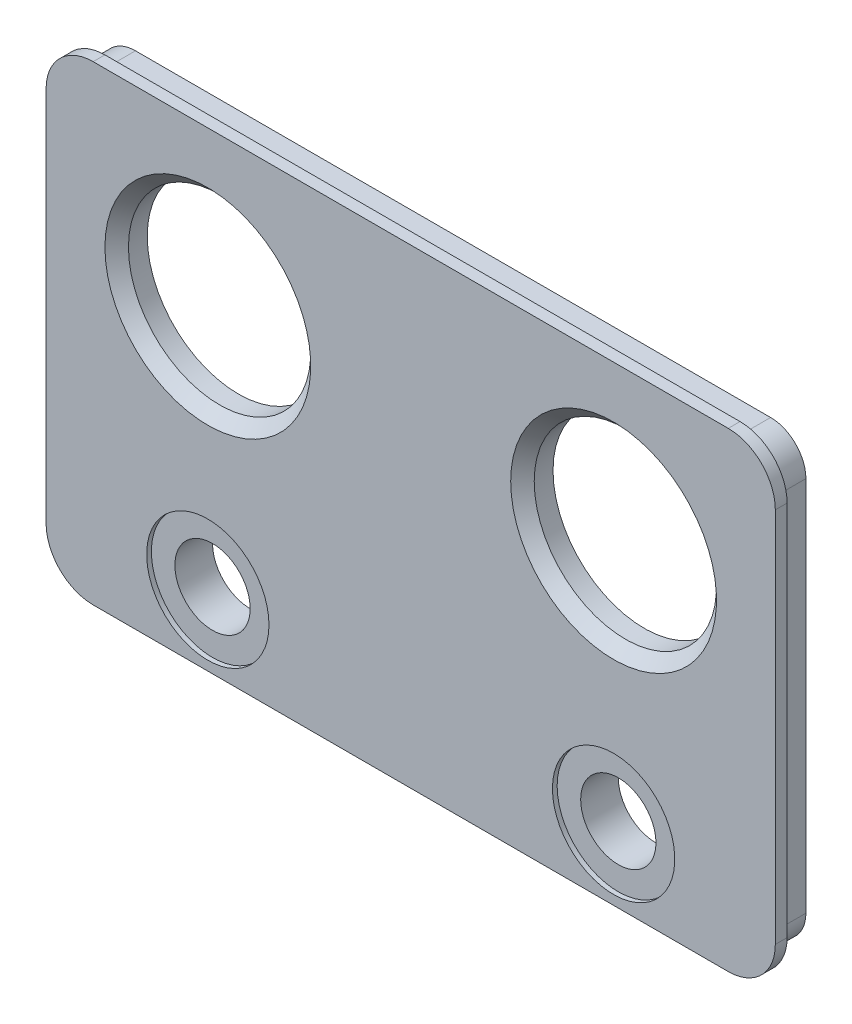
from build123d import *

# Parameters (mm, degrees)
ESQUISSE1_R             = 16
ESQUISSE1_R_2           = 38.75
BOSS_EXTRU_2_DEPTH      = 18
ENL_V_START             = -2
ESQUISSE2_R             = 26
ESQUISSE2_R_2           = 16
ENL_V_MAT_EXTRU_1_DEPTH = 2
CHANFREIN1_SIZE         = 5
ENL_V_MAT_EXTRU_2_DEPTH = 5
ENL_V_MAT_EXTRU_3_DEPTH = 13


with BuildPart() as part:
    # Esquisse1 → Boss.-Extru.2 (new body)
    with BuildSketch(Plane.XY):
        with BuildLine():
            Line((-135, -100), (135, -100))
            ThreePointArc((135, -100), (149.142135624, -94.142135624), (155, -80))
            Line((155, -80), (155, 80))
            ThreePointArc((155, 80), (149.142135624, 94.142135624), (135, 100))
            Line((135, 100), (-135, 100))
            ThreePointArc((-135, 100), (-149.142135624, 94.142135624), (-155, 80))
            Line((-155, 80), (-155, -80))
            ThreePointArc((-155, -80), (-149.142135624, -94.142135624), (-135, -100))
        make_face()
        with Locations((-86.25, -70)):
            Circle(ESQUISSE1_R, mode=Mode.SUBTRACT)
        with Locations((-86.25, 34.25)):
            Circle(ESQUISSE1_R_2, mode=Mode.SUBTRACT)
        with Locations(Location((86.25, -70, 0), (0, 0, 180))):
            Circle(ESQUISSE1_R, mode=Mode.SUBTRACT)
        with Locations(Location((86.25, 34.25, 0), (0, 0, 180))):
            Circle(ESQUISSE1_R_2, mode=Mode.SUBTRACT)
    extrude(amount=BOSS_EXTRU_2_DEPTH)

    # Esquisse2 → Enl_v. mat.-Extru.1 (cut)
    # profile 1 of 2: a face of its own
    with BuildSketch(Plane.XY.offset(18).offset(ENL_V_START)):
        with Locations((-86.25, -70)):
            Circle(ESQUISSE2_R)
        with Locations((-86.25, -70)):
            Circle(ESQUISSE2_R_2, mode=Mode.SUBTRACT)
    # profile 2 of 2: a face of its own
    with BuildSketch(Plane.XY.offset(18).offset(ENL_V_START)):
        with Locations(Location((86.25, -70, 0), (0, 0, 180))):
            Circle(ESQUISSE2_R)
        with Locations(Location((86.25, -70, 0), (0, 0, 180))):
            Circle(ESQUISSE2_R_2, mode=Mode.SUBTRACT)
    extrude(amount=ENL_V_MAT_EXTRU_1_DEPTH, mode=Mode.SUBTRACT)

    # Chanfrein1
    chanfrein1_edges = [part.edges().sort_by_distance(p)[0] for p in [
        (-125, 34.25, 18),
        (125, 34.25, 18),
    ]]
    chamfer(chanfrein1_edges, length=CHANFREIN1_SIZE)

    # Esquisse4 → Enl_v. mat.-Extru.2 (cut)
    with BuildSketch(Plane(origin=(0, 0, 0), x_dir=(-1, 0, 0), z_dir=(0, 0, -1))):
        with BuildLine():
            ThreePointArc((-123.649535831, 75.583228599), (-86.25, 79.25), (-48.850464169, 75.583228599))
            ThreePointArc((-48.850464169, 75.583228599), (-46.286027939, 74.213972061), (-44.916771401, 71.649535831))
            ThreePointArc((-44.916771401, 71.649535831), (-41.25, 34.25), (-44.916771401, -3.149535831))
            ThreePointArc((-44.916771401, -3.149535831), (-46.286027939, -5.713972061), (-48.850464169, -7.083228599))
            ThreePointArc((-48.850464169, -7.083228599), (-86.25, -10.75), (-123.649535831, -7.083228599))
            ThreePointArc((-123.649535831, -7.083228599), (-126.213972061, -5.713972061), (-127.583228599, -3.149535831))
            ThreePointArc((-127.583228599, -3.149535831), (-131.25, 34.25), (-127.583228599, 71.649535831))
            ThreePointArc((-127.583228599, 71.649535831), (-126.213972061, 74.213972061), (-123.649535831, 75.583228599))
        make_face()
        with BuildLine():
            ThreePointArc((123.649535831, 75.583228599), (86.25, 79.25), (48.850464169, 75.583228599))
            ThreePointArc((48.850464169, 75.583228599), (46.286027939, 74.213972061), (44.916771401, 71.649535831))
            ThreePointArc((44.916771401, 71.649535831), (41.25, 34.25), (44.916771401, -3.149535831))
            ThreePointArc((44.916771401, -3.149535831), (46.286027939, -5.713972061), (48.850464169, -7.083228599))
            ThreePointArc((48.850464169, -7.083228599), (86.25, -10.75), (123.649535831, -7.083228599))
            ThreePointArc((123.649535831, -7.083228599), (126.213972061, -5.713972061), (127.583228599, -3.149535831))
            ThreePointArc((127.583228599, -3.149535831), (131.25, 34.25), (127.583228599, 71.649535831))
            ThreePointArc((127.583228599, 71.649535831), (126.213972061, 74.213972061), (123.649535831, 75.583228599))
        make_face()
    extrude(amount=-ENL_V_MAT_EXTRU_2_DEPTH, mode=Mode.SUBTRACT)

    # Esquisse6 → Enl_v. mat.-Extru.3 (cut)
    with BuildSketch(Plane(origin=(0, 0, 0), x_dir=(-1, 0, 0), z_dir=(0, 0, -1))):
        with BuildLine():
            Line((-155, 80), (-155, -80))
            ThreePointArc((-155, -80), (-149.142135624, -94.142135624), (-135, -100))
            Line((-135, -100), (135, -100))
            ThreePointArc((135, -100), (149.142135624, -94.142135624), (155, -80))
            Line((155, -80), (155, 80))
            ThreePointArc((155, 80), (149.142135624, 94.142135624), (135, 100))
            Line((135, 100), (-135, 100))
            ThreePointArc((-135, 100), (-149.142135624, 94.142135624), (-155, 80))
        make_face()
        with BuildLine():
            Line((-150, 80), (-150, -80))
            ThreePointArc((-150, -80), (-145.606601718, -90.606601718), (-135, -95))
            Line((-135, -95), (135, -95))
            ThreePointArc((135, -95), (145.606601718, -90.606601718), (150, -80))
            Line((150, -80), (150, 80))
            ThreePointArc((150, 80), (145.606601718, 90.606601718), (135, 95))
            Line((135, 95), (-135, 95))
            ThreePointArc((-135, 95), (-145.606601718, 90.606601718), (-150, 80))
        make_face(mode=Mode.SUBTRACT)
    extrude(amount=-ENL_V_MAT_EXTRU_3_DEPTH, mode=Mode.SUBTRACT)


solid = part.part
